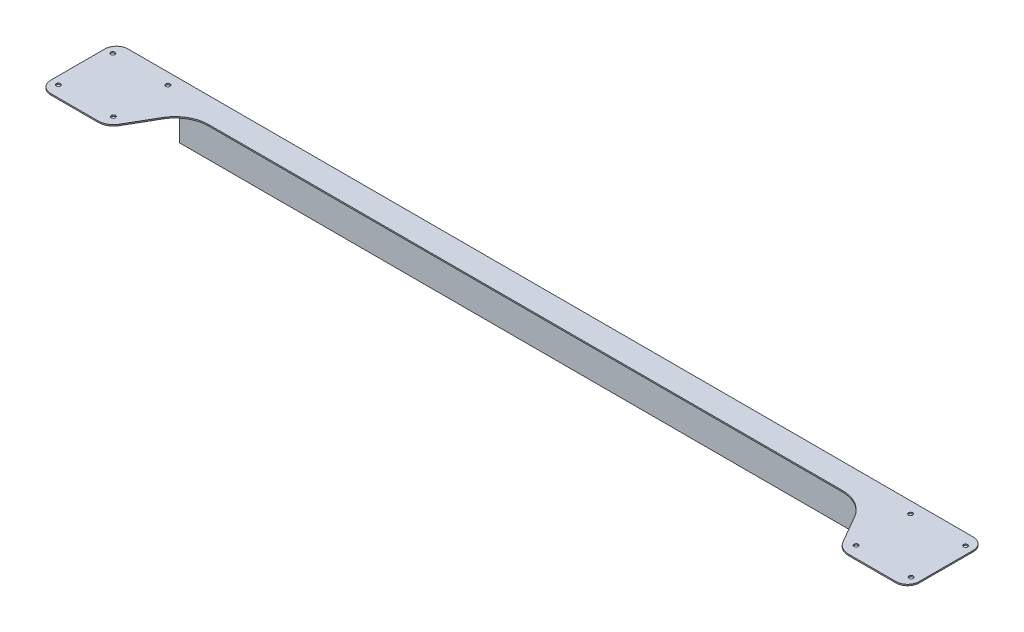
from build123d import *

# Parameters (mm, degrees)
SKETCH2_R           = 20.6375
BOSS_EXTRUDE1_DEPTH = 12.7
SKETCH3_W           = 7026.392259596
SKETCH3_H           = 4.7625
BOSS_EXTRUDE2_DEPTH = 406.4


with BuildPart() as part:
    # Sketch2 → Boss-Extrude1 (new body)
    with BuildSketch(Plane(origin=(0, 0, 0), x_dir=(1, 0, 0), z_dir=(0, 1, 0))):
        with BuildLine():
            Line((-4141.940541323, -3531.357125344), (4141.940541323, -3531.357125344))
            ThreePointArc((4141.940541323, -3531.357125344), (4222.762846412, -3564.834820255), (4256.240541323, -3645.657125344))
            Line((4256.240541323, -3645.657125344), (4256.240541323, -4174.579541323))
            ThreePointArc((4256.240541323, -4174.579541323), (4222.762846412, -4255.401846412), (4141.940541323, -4288.879541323))
            Line((4141.940541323, -4288.879541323), (3678.296125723, -4288.879541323))
            ThreePointArc((3678.296125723, -4288.879541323), (3602.096125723, -4268.461812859), (3546.313854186, -4212.679541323))
            Line((3546.313854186, -4212.679541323), (3390.553542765, -3942.894768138))
            ThreePointArc((3390.553542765, -3942.894768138), (3269.691954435, -3822.033179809), (3104.591954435, -3777.794768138))
            Line((3104.591954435, -3777.794768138), (-3104.591936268, -3777.794768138))
            ThreePointArc((-3104.591936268, -3777.794768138), (-3269.691936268, -3822.033179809), (-3390.553524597, -3942.894768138))
            Line((-3390.553524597, -3942.894768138), (-3546.313836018, -4212.679541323))
            ThreePointArc((-3546.313836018, -4212.679541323), (-3602.096107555, -4268.461812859), (-3678.296107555, -4288.879541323))
            Line((-3678.296107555, -4288.879541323), (-4141.940541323, -4288.879541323))
            ThreePointArc((-4141.940541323, -4288.879541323), (-4222.762846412, -4255.401846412), (-4256.240541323, -4174.579541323))
            Line((-4256.240541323, -4174.579541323), (-4256.240541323, -3645.657125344))
            ThreePointArc((-4256.240541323, -3645.657125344), (-4222.762846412, -3564.834820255), (-4141.940541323, -3531.357125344))
        make_face()
        with Locations(Location((-4180.040541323, -3643.117125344, 0), (0, 0, 270))):
            Circle(SKETCH2_R, mode=Mode.SUBTRACT)
        with Locations(Location((-4180.040541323, -4177.119541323, 0), (0, 0, 270))):
            Circle(SKETCH2_R, mode=Mode.SUBTRACT)
        with Locations(Location((-3640.196125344, -3643.117125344, 0), (0, 0, 270))):
            Circle(SKETCH2_R, mode=Mode.SUBTRACT)
        with Locations(Location((-3640.196125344, -4177.119541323, 0), (0, 0, 270))):
            Circle(SKETCH2_R, mode=Mode.SUBTRACT)
        with Locations(Location((3640.196125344, -3643.117125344, 0), (0, 0, 270))):
            Circle(SKETCH2_R, mode=Mode.SUBTRACT)
        with Locations(Location((4180.040541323, -3643.117125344, 0), (0, 0, 270))):
            Circle(SKETCH2_R, mode=Mode.SUBTRACT)
        with Locations(Location((4180.040541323, -4177.119541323, 0), (0, 0, 270))):
            Circle(SKETCH2_R, mode=Mode.SUBTRACT)
        with Locations(Location((3640.196125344, -4177.119541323, 0), (0, 0, 270))):
            Circle(SKETCH2_R, mode=Mode.SUBTRACT)
    extrude(amount=BOSS_EXTRUDE1_DEPTH)

    # Sketch3 → Boss-Extrude2 (add)
    with BuildSketch(Plane(origin=(0, 0, 0), x_dir=(1, 0, 0), z_dir=(0, 1, 0))):
        with Locations((4.454e-06, -3654.575946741)):
            Rectangle(SKETCH3_W, SKETCH3_H)
    extrude(amount=-BOSS_EXTRUDE2_DEPTH)


solid = part.part
